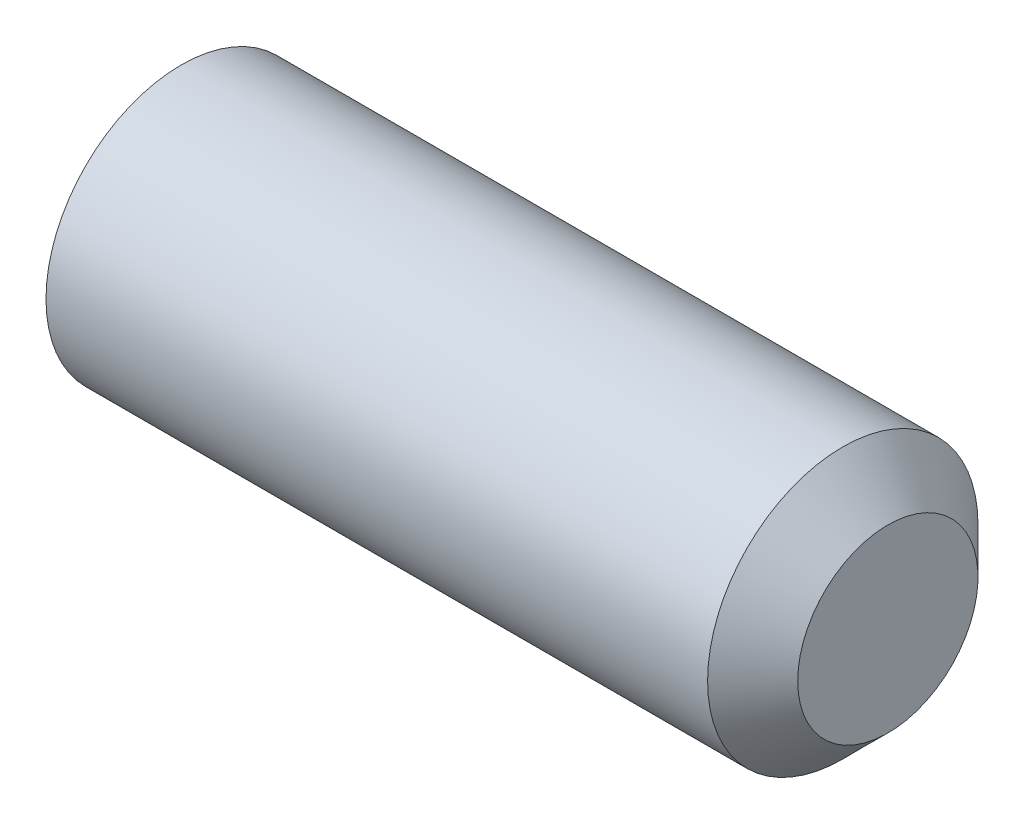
from build123d import *

# Parameters (mm, degrees)
HEX_2_DEPTH = 3.5


with BuildPart() as part:
    # BodySke → BaseBody (revolve)
    with BuildSketch(Plane.XY, mode=Mode.PRIVATE) as basebody_sk:
        Polygon((0, 0), (0, 2.4455), (0.320140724, 3), (15, 3), (16, 2), (16, 0), align=None)
    revolve(basebody_sk.sketch.rotate(Axis((-12.7, 0, 0), (1, 0, 0)), 90), axis=Axis((-12.7, 0, 0), (1, 0, 0)))

    # Sketch2 → Hex 2 (cut)
    with BuildSketch(Plane.ZY):
        Polygon((0.866025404, 1.5), (-0.866025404, 1.5), (-1.732050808, 0), (-0.866025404, -1.5), (0.866025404, -1.5), (1.732050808, 0), align=None)
    extrude(amount=-HEX_2_DEPTH, mode=Mode.SUBTRACT)


solid = part.part
